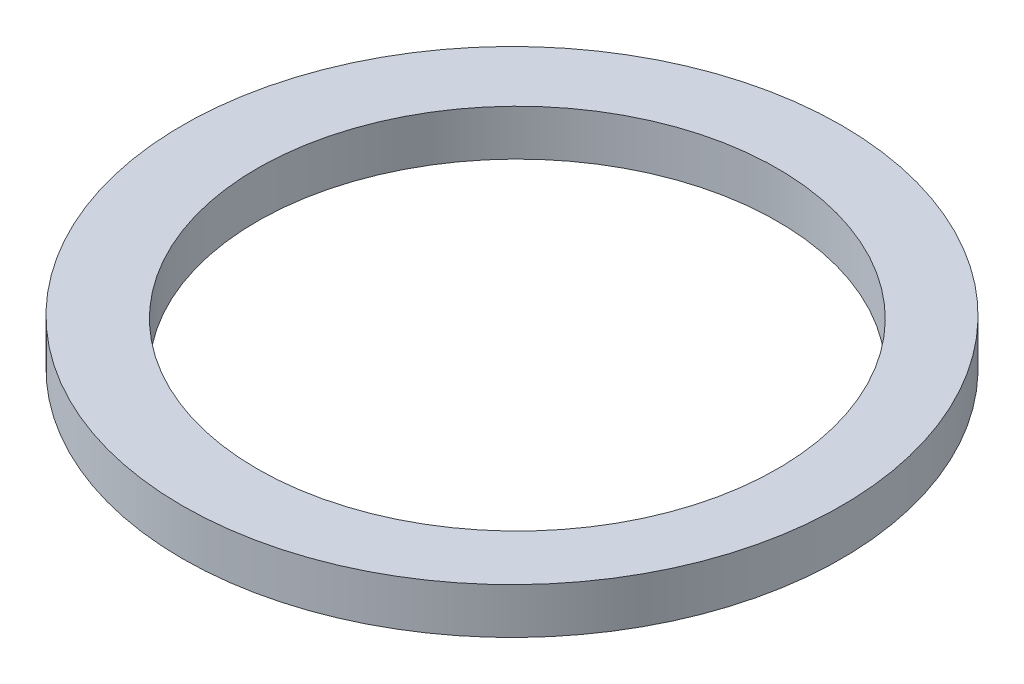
ISO-10303-21;
HEADER;
FILE_DESCRIPTION(('STEP AP214'),'2;1');
FILE_NAME('part.step','',(''),(''),'','','');
FILE_SCHEMA(('AUTOMOTIVE_DESIGN { 1 0 10303 214 1 1 1 1 }'));
ENDSEC;
DATA;
#1=APPLICATION_CONTEXT('core data for automotive mechanical design processes');
#2=APPLICATION_PROTOCOL_DEFINITION('international standard','automotive_design',2000,#1);
#3=PRODUCT_CONTEXT('',#1,'mechanical');
#4=PRODUCT('Part','Part','',(#3));
#5=PRODUCT_RELATED_PRODUCT_CATEGORY('part','',(#4));
#6=PRODUCT_DEFINITION_FORMATION('','',#4);
#7=PRODUCT_DEFINITION_CONTEXT('part definition',#1,'design');
#8=PRODUCT_DEFINITION('design','',#6,#7);
#9=PRODUCT_DEFINITION_SHAPE('','',#8);
#10=(LENGTH_UNIT() NAMED_UNIT(*) SI_UNIT(.MILLI.,.METRE.));
#11=(NAMED_UNIT(*) PLANE_ANGLE_UNIT() SI_UNIT($,.RADIAN.));
#12=(NAMED_UNIT(*) SI_UNIT($,.STERADIAN.) SOLID_ANGLE_UNIT());
#13=UNCERTAINTY_MEASURE_WITH_UNIT(LENGTH_MEASURE(1.E-05),#10,'distance_accuracy_value','');
#14=(GEOMETRIC_REPRESENTATION_CONTEXT(3) GLOBAL_UNCERTAINTY_ASSIGNED_CONTEXT((#13)) GLOBAL_UNIT_ASSIGNED_CONTEXT((#10,
#11,#12)) REPRESENTATION_CONTEXT('',''));
#15=CARTESIAN_POINT('',(0.,0.,0.));
#16=DIRECTION('',(0.,0.,1.));
#17=DIRECTION('',(1.,0.,0.));
#18=AXIS2_PLACEMENT_3D('',#15,#16,#17);
#19=CARTESIAN_POINT('',(0.,1.67639999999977,0.));
#20=DIRECTION('',(0.,-1.,0.));
#21=DIRECTION('',(0.,0.,-1.00000000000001));
#22=AXIS2_PLACEMENT_3D('',#19,#20,#21);
#23=CYLINDRICAL_SURFACE('',#22,12.065);
#24=CARTESIAN_POINT('',(0.,1.67639999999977,0.));
#25=DIRECTION('',(0.,1.,0.));
#26=DIRECTION('',(0.,0.,1.00000000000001));
#27=AXIS2_PLACEMENT_3D('',#24,#25,#26);
#28=CIRCLE('',#27,12.065);
#29=CARTESIAN_POINT('',(0.,1.67639999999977,12.0650000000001));
#30=VERTEX_POINT('',#29);
#31=EDGE_CURVE('E10',#30,#30,#28,.T.);
#32=ORIENTED_EDGE('',*,*,#31,.F.);
#33=EDGE_LOOP('',(#32));
#34=FACE_BOUND('',#33,.T.);
#35=CARTESIAN_POINT('',(0.,-2.22044604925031E-13,0.));
#36=DIRECTION('',(0.,1.,0.));
#37=DIRECTION('',(0.,0.,1.00000000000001));
#38=AXIS2_PLACEMENT_3D('',#35,#36,#37);
#39=CIRCLE('',#38,12.065);
#40=CARTESIAN_POINT('',(0.,-2.22044604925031E-13,12.0650000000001));
#41=VERTEX_POINT('',#40);
#42=EDGE_CURVE('E35',#41,#41,#39,.T.);
#43=ORIENTED_EDGE('',*,*,#42,.T.);
#44=EDGE_LOOP('',(#43));
#45=FACE_BOUND('',#44,.T.);
#46=ADVANCED_FACE('F28',(#34,#45),#23,.T.);
#47=CARTESIAN_POINT('',(0.,1.67639999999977,0.));
#48=DIRECTION('',(0.,1.,0.));
#49=DIRECTION('',(0.,0.,1.00000000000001));
#50=AXIS2_PLACEMENT_3D('',#47,#48,#49);
#51=PLANE('',#50);
#52=CARTESIAN_POINT('',(0.195226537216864,1.67639999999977,0.));
#53=DIRECTION('',(0.,1.,0.));
#54=DIRECTION('',(0.,0.,1.00000000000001));
#55=AXIS2_PLACEMENT_3D('',#52,#53,#54);
#56=CIRCLE('',#55,9.525);
#57=CARTESIAN_POINT('',(0.195226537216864,1.67639999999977,9.52500000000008));
#58=VERTEX_POINT('',#57);
#59=EDGE_CURVE('E41',#58,#58,#56,.T.);
#60=ORIENTED_EDGE('',*,*,#59,.F.);
#61=EDGE_LOOP('',(#60));
#62=FACE_BOUND('',#61,.T.);
#63=ORIENTED_EDGE('',*,*,#31,.T.);
#64=EDGE_LOOP('',(#63));
#65=FACE_BOUND('',#64,.T.);
#66=ADVANCED_FACE('F57',(#62,#65),#51,.T.);
#67=CARTESIAN_POINT('',(0.,-2.22044604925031E-13,0.));
#68=DIRECTION('',(0.,1.,0.));
#69=DIRECTION('',(0.,0.,1.00000000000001));
#70=AXIS2_PLACEMENT_3D('',#67,#68,#69);
#71=PLANE('',#70);
#72=CARTESIAN_POINT('',(0.195226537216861,-2.22044604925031E-13,0.));
#73=DIRECTION('',(0.,1.,0.));
#74=DIRECTION('',(0.,0.,1.00000000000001));
#75=AXIS2_PLACEMENT_3D('',#72,#73,#74);
#76=CIRCLE('',#75,9.525);
#77=CARTESIAN_POINT('',(0.195226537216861,-2.22044604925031E-13,9.52500000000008));
#78=VERTEX_POINT('',#77);
#79=EDGE_CURVE('E31',#78,#78,#76,.T.);
#80=ORIENTED_EDGE('',*,*,#79,.T.);
#81=EDGE_LOOP('',(#80));
#82=FACE_BOUND('',#81,.T.);
#83=ORIENTED_EDGE('',*,*,#42,.F.);
#84=EDGE_LOOP('',(#83));
#85=FACE_BOUND('',#84,.T.);
#86=ADVANCED_FACE('F48',(#82,#85),#71,.F.);
#87=CARTESIAN_POINT('',(0.195226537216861,-0.863600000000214,0.));
#88=DIRECTION('',(0.,1.,0.));
#89=DIRECTION('',(0.,0.,1.00000000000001));
#90=AXIS2_PLACEMENT_3D('',#87,#88,#89);
#91=CYLINDRICAL_SURFACE('',#90,9.525);
#92=ORIENTED_EDGE('',*,*,#59,.T.);
#93=EDGE_LOOP('',(#92));
#94=FACE_BOUND('',#93,.T.);
#95=ORIENTED_EDGE('',*,*,#79,.F.);
#96=EDGE_LOOP('',(#95));
#97=FACE_BOUND('',#96,.T.);
#98=ADVANCED_FACE('F51',(#94,#97),#91,.F.);
#99=CLOSED_SHELL('',(#46,#66,#86,#98));
#100=MANIFOLD_SOLID_BREP('B2',#99);
#101=ADVANCED_BREP_SHAPE_REPRESENTATION('',(#18,#100),#14);
#102=SHAPE_DEFINITION_REPRESENTATION(#9,#101);
ENDSEC;
END-ISO-10303-21;
